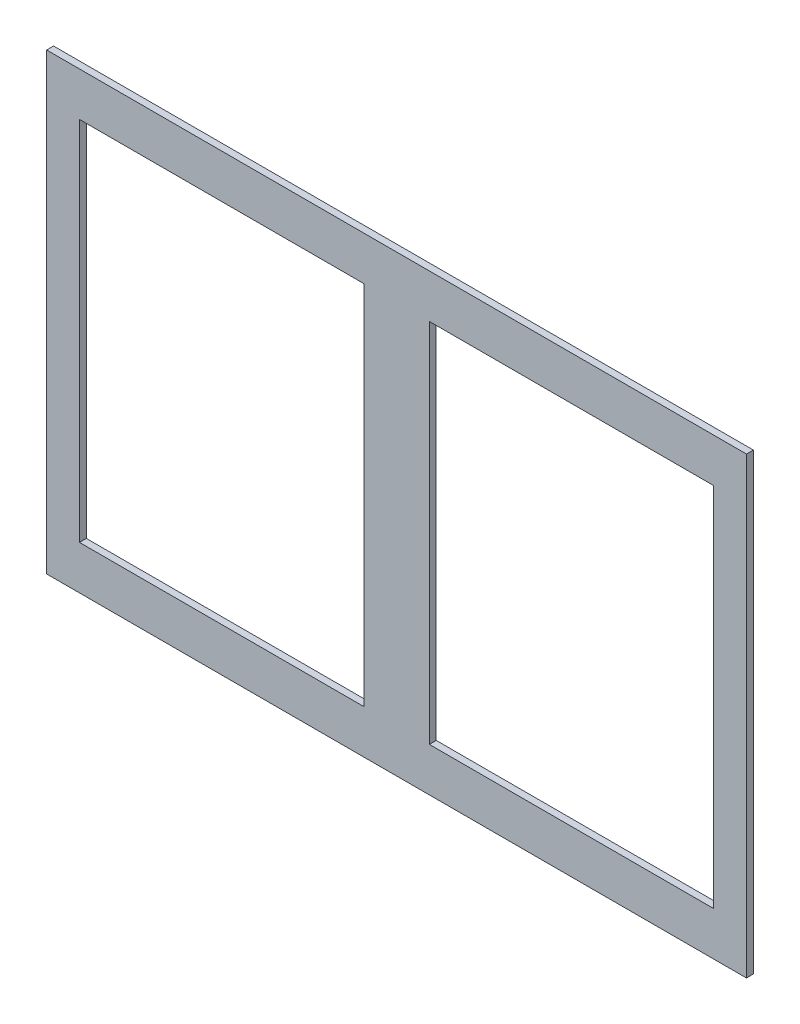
ISO-10303-21;
HEADER;
FILE_DESCRIPTION(('STEP AP214'),'2;1');
FILE_NAME('part.step','',(''),(''),'','','');
FILE_SCHEMA(('AUTOMOTIVE_DESIGN { 1 0 10303 214 1 1 1 1 }'));
ENDSEC;
DATA;
#1=APPLICATION_CONTEXT('core data for automotive mechanical design processes');
#2=APPLICATION_PROTOCOL_DEFINITION('international standard','automotive_design',2000,#1);
#3=PRODUCT_CONTEXT('',#1,'mechanical');
#4=PRODUCT('Part','Part','',(#3));
#5=PRODUCT_RELATED_PRODUCT_CATEGORY('part','',(#4));
#6=PRODUCT_DEFINITION_FORMATION('','',#4);
#7=PRODUCT_DEFINITION_CONTEXT('part definition',#1,'design');
#8=PRODUCT_DEFINITION('design','',#6,#7);
#9=PRODUCT_DEFINITION_SHAPE('','',#8);
#10=(LENGTH_UNIT() NAMED_UNIT(*) SI_UNIT(.MILLI.,.METRE.));
#11=(NAMED_UNIT(*) PLANE_ANGLE_UNIT() SI_UNIT($,.RADIAN.));
#12=(NAMED_UNIT(*) SI_UNIT($,.STERADIAN.) SOLID_ANGLE_UNIT());
#13=UNCERTAINTY_MEASURE_WITH_UNIT(LENGTH_MEASURE(1.E-05),#10,'distance_accuracy_value','');
#14=(GEOMETRIC_REPRESENTATION_CONTEXT(3) GLOBAL_UNCERTAINTY_ASSIGNED_CONTEXT((#13)) GLOBAL_UNIT_ASSIGNED_CONTEXT((#10,
#11,#12)) REPRESENTATION_CONTEXT('',''));
#15=CARTESIAN_POINT('',(0.,0.,0.));
#16=DIRECTION('',(0.,0.,1.));
#17=DIRECTION('',(1.,0.,0.));
#18=AXIS2_PLACEMENT_3D('',#15,#16,#17);
#19=CARTESIAN_POINT('',(0.,425.45,16.));
#20=DIRECTION('',(0.,-1.,0.));
#21=DIRECTION('',(1.,0.,0.));
#22=AXIS2_PLACEMENT_3D('',#19,#20,#21);
#23=PLANE('',#22);
#24=DIRECTION('',(-1.,0.,0.));
#25=VECTOR('',#24,1.);
#26=CARTESIAN_POINT('',(0.,425.45,0.));
#27=LINE('',#26,#25);
#28=CARTESIAN_POINT('',(1143.,425.45,0.));
#29=VERTEX_POINT('',#28);
#30=CARTESIAN_POINT('',(482.6,425.45,0.));
#31=VERTEX_POINT('',#30);
#32=EDGE_CURVE('E211',#29,#31,#27,.T.);
#33=ORIENTED_EDGE('',*,*,#32,.F.);
#34=DIRECTION('',(0.,0.,-1.));
#35=VECTOR('',#34,1.);
#36=CARTESIAN_POINT('',(1143.,425.45,16.));
#37=LINE('',#36,#35);
#38=CARTESIAN_POINT('',(1143.,425.45,16.));
#39=VERTEX_POINT('',#38);
#40=EDGE_CURVE('E11',#39,#29,#37,.T.);
#41=ORIENTED_EDGE('',*,*,#40,.F.);
#42=DIRECTION('',(-1.,0.,0.));
#43=VECTOR('',#42,1.);
#44=CARTESIAN_POINT('',(0.,425.45,16.));
#45=LINE('',#44,#43);
#46=CARTESIAN_POINT('',(482.6,425.45,16.));
#47=VERTEX_POINT('',#46);
#48=EDGE_CURVE('E147',#39,#47,#45,.T.);
#49=ORIENTED_EDGE('',*,*,#48,.T.);
#50=DIRECTION('',(0.,0.,-1.));
#51=VECTOR('',#50,1.);
#52=CARTESIAN_POINT('',(482.6,425.45,16.));
#53=LINE('',#52,#51);
#54=EDGE_CURVE('E56',#47,#31,#53,.T.);
#55=ORIENTED_EDGE('',*,*,#54,.T.);
#56=EDGE_LOOP('',(#33,#41,#49,#55));
#57=FACE_BOUND('',#56,.T.);
#58=ADVANCED_FACE('F37',(#57),#23,.T.);
#59=CARTESIAN_POINT('',(1143.,0.,16.));
#60=DIRECTION('',(1.,0.,0.));
#61=DIRECTION('',(0.,0.,-1.));
#62=AXIS2_PLACEMENT_3D('',#59,#60,#61);
#63=PLANE('',#62);
#64=DIRECTION('',(0.,-1.,0.));
#65=VECTOR('',#64,1.);
#66=CARTESIAN_POINT('',(1143.,0.,0.));
#67=LINE('',#66,#65);
#68=CARTESIAN_POINT('',(1143.,-425.45,0.));
#69=VERTEX_POINT('',#68);
#70=EDGE_CURVE('E152',#29,#69,#67,.T.);
#71=ORIENTED_EDGE('',*,*,#70,.T.);
#72=DIRECTION('',(0.,0.,-1.));
#73=VECTOR('',#72,1.);
#74=CARTESIAN_POINT('',(1143.,-425.45,16.));
#75=LINE('',#74,#73);
#76=CARTESIAN_POINT('',(1143.,-425.45,16.));
#77=VERTEX_POINT('',#76);
#78=EDGE_CURVE('E47',#77,#69,#75,.T.);
#79=ORIENTED_EDGE('',*,*,#78,.F.);
#80=DIRECTION('',(0.,-1.,0.));
#81=VECTOR('',#80,1.);
#82=CARTESIAN_POINT('',(1143.,0.,16.));
#83=LINE('',#82,#81);
#84=EDGE_CURVE('E142',#39,#77,#83,.T.);
#85=ORIENTED_EDGE('',*,*,#84,.F.);
#86=ORIENTED_EDGE('',*,*,#40,.T.);
#87=EDGE_LOOP('',(#71,#79,#85,#86));
#88=FACE_BOUND('',#87,.T.);
#89=ADVANCED_FACE('F150',(#88),#63,.F.);
#90=CARTESIAN_POINT('',(0.,-425.45,16.));
#91=DIRECTION('',(0.,-1.,0.));
#92=DIRECTION('',(1.,0.,0.));
#93=AXIS2_PLACEMENT_3D('',#90,#91,#92);
#94=PLANE('',#93);
#95=DIRECTION('',(-1.,0.,0.));
#96=VECTOR('',#95,1.);
#97=CARTESIAN_POINT('',(0.,-425.45,0.));
#98=LINE('',#97,#96);
#99=CARTESIAN_POINT('',(482.6,-425.45,0.));
#100=VERTEX_POINT('',#99);
#101=EDGE_CURVE('E214',#69,#100,#98,.T.);
#102=ORIENTED_EDGE('',*,*,#101,.T.);
#103=DIRECTION('',(0.,0.,-1.));
#104=VECTOR('',#103,1.);
#105=CARTESIAN_POINT('',(482.6,-425.45,16.));
#106=LINE('',#105,#104);
#107=CARTESIAN_POINT('',(482.6,-425.45,16.));
#108=VERTEX_POINT('',#107);
#109=EDGE_CURVE('E94',#108,#100,#106,.T.);
#110=ORIENTED_EDGE('',*,*,#109,.F.);
#111=DIRECTION('',(-1.,0.,0.));
#112=VECTOR('',#111,1.);
#113=CARTESIAN_POINT('',(0.,-425.45,16.));
#114=LINE('',#113,#112);
#115=EDGE_CURVE('E134',#77,#108,#114,.T.);
#116=ORIENTED_EDGE('',*,*,#115,.F.);
#117=ORIENTED_EDGE('',*,*,#78,.T.);
#118=EDGE_LOOP('',(#102,#110,#116,#117));
#119=FACE_BOUND('',#118,.T.);
#120=ADVANCED_FACE('F136',(#119),#94,.F.);
#121=CARTESIAN_POINT('',(0.,425.45,16.));
#122=DIRECTION('',(0.,1.,0.));
#123=DIRECTION('',(-1.,0.,0.));
#124=AXIS2_PLACEMENT_3D('',#121,#122,#123);
#125=PLANE('',#124);
#126=DIRECTION('',(1.,0.,0.));
#127=VECTOR('',#126,1.);
#128=CARTESIAN_POINT('',(0.,425.45,0.));
#129=LINE('',#128,#127);
#130=CARTESIAN_POINT('',(-330.2,425.45,0.));
#131=VERTEX_POINT('',#130);
#132=CARTESIAN_POINT('',(330.2,425.45,0.));
#133=VERTEX_POINT('',#132);
#134=EDGE_CURVE('E199',#131,#133,#129,.T.);
#135=ORIENTED_EDGE('',*,*,#134,.T.);
#136=DIRECTION('',(0.,0.,-1.));
#137=VECTOR('',#136,1.);
#138=CARTESIAN_POINT('',(330.2,425.45,16.));
#139=LINE('',#138,#137);
#140=CARTESIAN_POINT('',(330.2,425.45,16.));
#141=VERTEX_POINT('',#140);
#142=EDGE_CURVE('E163',#141,#133,#139,.T.);
#143=ORIENTED_EDGE('',*,*,#142,.F.);
#144=DIRECTION('',(1.,0.,0.));
#145=VECTOR('',#144,1.);
#146=CARTESIAN_POINT('',(0.,425.45,16.));
#147=LINE('',#146,#145);
#148=CARTESIAN_POINT('',(-330.2,425.45,16.));
#149=VERTEX_POINT('',#148);
#150=EDGE_CURVE('E226',#149,#141,#147,.T.);
#151=ORIENTED_EDGE('',*,*,#150,.F.);
#152=DIRECTION('',(0.,0.,-1.));
#153=VECTOR('',#152,1.);
#154=CARTESIAN_POINT('',(-330.2,425.45,16.));
#155=LINE('',#154,#153);
#156=EDGE_CURVE('E157',#149,#131,#155,.T.);
#157=ORIENTED_EDGE('',*,*,#156,.T.);
#158=EDGE_LOOP('',(#135,#143,#151,#157));
#159=FACE_BOUND('',#158,.T.);
#160=ADVANCED_FACE('F269',(#159),#125,.F.);
#161=CARTESIAN_POINT('',(330.2,0.,16.));
#162=DIRECTION('',(1.,0.,0.));
#163=DIRECTION('',(0.,0.,-1.));
#164=AXIS2_PLACEMENT_3D('',#161,#162,#163);
#165=PLANE('',#164);
#166=DIRECTION('',(0.,-1.,0.));
#167=VECTOR('',#166,1.);
#168=CARTESIAN_POINT('',(330.2,0.,0.));
#169=LINE('',#168,#167);
#170=CARTESIAN_POINT('',(330.2,-425.45,0.));
#171=VERTEX_POINT('',#170);
#172=EDGE_CURVE('E202',#133,#171,#169,.T.);
#173=ORIENTED_EDGE('',*,*,#172,.T.);
#174=DIRECTION('',(0.,0.,-1.));
#175=VECTOR('',#174,1.);
#176=CARTESIAN_POINT('',(330.2,-425.45,16.));
#177=LINE('',#176,#175);
#178=CARTESIAN_POINT('',(330.2,-425.45,16.));
#179=VERTEX_POINT('',#178);
#180=EDGE_CURVE('E161',#179,#171,#177,.T.);
#181=ORIENTED_EDGE('',*,*,#180,.F.);
#182=DIRECTION('',(0.,-1.,0.));
#183=VECTOR('',#182,1.);
#184=CARTESIAN_POINT('',(330.2,0.,16.));
#185=LINE('',#184,#183);
#186=EDGE_CURVE('E229',#141,#179,#185,.T.);
#187=ORIENTED_EDGE('',*,*,#186,.F.);
#188=ORIENTED_EDGE('',*,*,#142,.T.);
#189=EDGE_LOOP('',(#173,#181,#187,#188));
#190=FACE_BOUND('',#189,.T.);
#191=ADVANCED_FACE('F265',(#190),#165,.F.);
#192=CARTESIAN_POINT('',(0.,-425.45,16.));
#193=DIRECTION('',(0.,1.,0.));
#194=DIRECTION('',(-1.,0.,0.));
#195=AXIS2_PLACEMENT_3D('',#192,#193,#194);
#196=PLANE('',#195);
#197=DIRECTION('',(1.,0.,0.));
#198=VECTOR('',#197,1.);
#199=CARTESIAN_POINT('',(0.,-425.45,0.));
#200=LINE('',#199,#198);
#201=CARTESIAN_POINT('',(-330.2,-425.45,0.));
#202=VERTEX_POINT('',#201);
#203=EDGE_CURVE('E205',#202,#171,#200,.T.);
#204=ORIENTED_EDGE('',*,*,#203,.F.);
#205=DIRECTION('',(0.,0.,-1.));
#206=VECTOR('',#205,1.);
#207=CARTESIAN_POINT('',(-330.2,-425.45,16.));
#208=LINE('',#207,#206);
#209=CARTESIAN_POINT('',(-330.2,-425.45,16.));
#210=VERTEX_POINT('',#209);
#211=EDGE_CURVE('E159',#210,#202,#208,.T.);
#212=ORIENTED_EDGE('',*,*,#211,.F.);
#213=DIRECTION('',(1.,0.,0.));
#214=VECTOR('',#213,1.);
#215=CARTESIAN_POINT('',(0.,-425.45,16.));
#216=LINE('',#215,#214);
#217=EDGE_CURVE('E231',#210,#179,#216,.T.);
#218=ORIENTED_EDGE('',*,*,#217,.T.);
#219=ORIENTED_EDGE('',*,*,#180,.T.);
#220=EDGE_LOOP('',(#204,#212,#218,#219));
#221=FACE_BOUND('',#220,.T.);
#222=ADVANCED_FACE('F262',(#221),#196,.T.);
#223=CARTESIAN_POINT('',(0.,-527.05,16.));
#224=DIRECTION('',(0.,1.,0.));
#225=DIRECTION('',(0.,0.,1.));
#226=AXIS2_PLACEMENT_3D('',#223,#224,#225);
#227=PLANE('',#226);
#228=DIRECTION('',(1.,0.,0.));
#229=VECTOR('',#228,1.);
#230=CARTESIAN_POINT('',(0.,-527.05,0.));
#231=LINE('',#230,#229);
#232=CARTESIAN_POINT('',(-406.4,-527.05,0.));
#233=VERTEX_POINT('',#232);
#234=CARTESIAN_POINT('',(1219.2,-527.05,0.));
#235=VERTEX_POINT('',#234);
#236=EDGE_CURVE('E185',#233,#235,#231,.T.);
#237=ORIENTED_EDGE('',*,*,#236,.T.);
#238=DIRECTION('',(0.,0.,-1.));
#239=VECTOR('',#238,1.);
#240=CARTESIAN_POINT('',(1219.2,-527.05,16.));
#241=LINE('',#240,#239);
#242=CARTESIAN_POINT('',(1219.2,-527.05,16.));
#243=VERTEX_POINT('',#242);
#244=EDGE_CURVE('E41',#243,#235,#241,.T.);
#245=ORIENTED_EDGE('',*,*,#244,.F.);
#246=DIRECTION('',(1.,0.,0.));
#247=VECTOR('',#246,1.);
#248=CARTESIAN_POINT('',(0.,-527.05,16.));
#249=LINE('',#248,#247);
#250=CARTESIAN_POINT('',(-406.4,-527.05,16.));
#251=VERTEX_POINT('',#250);
#252=EDGE_CURVE('E107',#251,#243,#249,.T.);
#253=ORIENTED_EDGE('',*,*,#252,.F.);
#254=DIRECTION('',(0.,0.,-1.));
#255=VECTOR('',#254,1.);
#256=CARTESIAN_POINT('',(-406.4,-527.05,16.));
#257=LINE('',#256,#255);
#258=EDGE_CURVE('E166',#251,#233,#257,.T.);
#259=ORIENTED_EDGE('',*,*,#258,.T.);
#260=EDGE_LOOP('',(#237,#245,#253,#259));
#261=FACE_BOUND('',#260,.T.);
#262=ADVANCED_FACE('F39',(#261),#227,.F.);
#263=CARTESIAN_POINT('',(1219.2,-2.5682267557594E-13,16.));
#264=DIRECTION('',(1.,0.,0.));
#265=DIRECTION('',(0.,1.,0.));
#266=AXIS2_PLACEMENT_3D('',#263,#264,#265);
#267=PLANE('',#266);
#268=DIRECTION('',(0.,-1.,0.));
#269=VECTOR('',#268,1.);
#270=CARTESIAN_POINT('',(1219.2,-2.5682267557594E-13,0.));
#271=LINE('',#270,#269);
#272=CARTESIAN_POINT('',(1219.2,527.05,0.));
#273=VERTEX_POINT('',#272);
#274=EDGE_CURVE('E180',#273,#235,#271,.T.);
#275=ORIENTED_EDGE('',*,*,#274,.F.);
#276=DIRECTION('',(0.,0.,-1.));
#277=VECTOR('',#276,1.);
#278=CARTESIAN_POINT('',(1219.2,527.05,16.));
#279=LINE('',#278,#277);
#280=CARTESIAN_POINT('',(1219.2,527.05,16.));
#281=VERTEX_POINT('',#280);
#282=EDGE_CURVE('E170',#281,#273,#279,.T.);
#283=ORIENTED_EDGE('',*,*,#282,.F.);
#284=DIRECTION('',(0.,-1.,0.));
#285=VECTOR('',#284,1.);
#286=CARTESIAN_POINT('',(1219.2,-2.5682267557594E-13,16.));
#287=LINE('',#286,#285);
#288=EDGE_CURVE('E182',#281,#243,#287,.T.);
#289=ORIENTED_EDGE('',*,*,#288,.T.);
#290=ORIENTED_EDGE('',*,*,#244,.T.);
#291=EDGE_LOOP('',(#275,#283,#289,#290));
#292=FACE_BOUND('',#291,.T.);
#293=ADVANCED_FACE('F178',(#292),#267,.T.);
#294=CARTESIAN_POINT('',(0.,527.05,16.));
#295=DIRECTION('',(0.,1.,0.));
#296=DIRECTION('',(0.,0.,1.));
#297=AXIS2_PLACEMENT_3D('',#294,#295,#296);
#298=PLANE('',#297);
#299=DIRECTION('',(1.,0.,0.));
#300=VECTOR('',#299,1.);
#301=CARTESIAN_POINT('',(0.,527.05,0.));
#302=LINE('',#301,#300);
#303=CARTESIAN_POINT('',(-406.4,527.05,0.));
#304=VERTEX_POINT('',#303);
#305=EDGE_CURVE('E192',#304,#273,#302,.T.);
#306=ORIENTED_EDGE('',*,*,#305,.F.);
#307=DIRECTION('',(0.,0.,-1.));
#308=VECTOR('',#307,1.);
#309=CARTESIAN_POINT('',(-406.4,527.05,16.));
#310=LINE('',#309,#308);
#311=CARTESIAN_POINT('',(-406.4,527.05,16.));
#312=VERTEX_POINT('',#311);
#313=EDGE_CURVE('E169',#312,#304,#310,.T.);
#314=ORIENTED_EDGE('',*,*,#313,.F.);
#315=DIRECTION('',(1.,0.,0.));
#316=VECTOR('',#315,1.);
#317=CARTESIAN_POINT('',(0.,527.05,16.));
#318=LINE('',#317,#316);
#319=EDGE_CURVE('E220',#312,#281,#318,.T.);
#320=ORIENTED_EDGE('',*,*,#319,.T.);
#321=ORIENTED_EDGE('',*,*,#282,.T.);
#322=EDGE_LOOP('',(#306,#314,#320,#321));
#323=FACE_BOUND('',#322,.T.);
#324=ADVANCED_FACE('F260',(#323),#298,.T.);
#325=CARTESIAN_POINT('',(-330.2,0.,16.));
#326=DIRECTION('',(1.,0.,0.));
#327=DIRECTION('',(0.,0.,-1.));
#328=AXIS2_PLACEMENT_3D('',#325,#326,#327);
#329=PLANE('',#328);
#330=DIRECTION('',(0.,-1.,0.));
#331=VECTOR('',#330,1.);
#332=CARTESIAN_POINT('',(-330.2,0.,0.));
#333=LINE('',#332,#331);
#334=EDGE_CURVE('E208',#131,#202,#333,.T.);
#335=ORIENTED_EDGE('',*,*,#334,.F.);
#336=ORIENTED_EDGE('',*,*,#156,.F.);
#337=DIRECTION('',(0.,-1.,0.));
#338=VECTOR('',#337,1.);
#339=CARTESIAN_POINT('',(-330.2,0.,16.));
#340=LINE('',#339,#338);
#341=EDGE_CURVE('E234',#149,#210,#340,.T.);
#342=ORIENTED_EDGE('',*,*,#341,.T.);
#343=ORIENTED_EDGE('',*,*,#211,.T.);
#344=EDGE_LOOP('',(#335,#336,#342,#343));
#345=FACE_BOUND('',#344,.T.);
#346=ADVANCED_FACE('F246',(#345),#329,.T.);
#347=CARTESIAN_POINT('',(-406.4,0.,16.));
#348=DIRECTION('',(1.,0.,0.));
#349=DIRECTION('',(0.,1.,0.));
#350=AXIS2_PLACEMENT_3D('',#347,#348,#349);
#351=PLANE('',#350);
#352=DIRECTION('',(0.,-1.,0.));
#353=VECTOR('',#352,1.);
#354=CARTESIAN_POINT('',(-406.4,0.,0.));
#355=LINE('',#354,#353);
#356=EDGE_CURVE('E194',#304,#233,#355,.T.);
#357=ORIENTED_EDGE('',*,*,#356,.T.);
#358=ORIENTED_EDGE('',*,*,#258,.F.);
#359=DIRECTION('',(0.,-1.,0.));
#360=VECTOR('',#359,1.);
#361=CARTESIAN_POINT('',(-406.4,0.,16.));
#362=LINE('',#361,#360);
#363=EDGE_CURVE('E224',#312,#251,#362,.T.);
#364=ORIENTED_EDGE('',*,*,#363,.F.);
#365=ORIENTED_EDGE('',*,*,#313,.T.);
#366=EDGE_LOOP('',(#357,#358,#364,#365));
#367=FACE_BOUND('',#366,.T.);
#368=ADVANCED_FACE('F239',(#367),#351,.F.);
#369=CARTESIAN_POINT('',(482.6,0.,16.));
#370=DIRECTION('',(1.,0.,0.));
#371=DIRECTION('',(0.,0.,-1.));
#372=AXIS2_PLACEMENT_3D('',#369,#370,#371);
#373=PLANE('',#372);
#374=DIRECTION('',(0.,-1.,0.));
#375=VECTOR('',#374,1.);
#376=CARTESIAN_POINT('',(482.6,0.,0.));
#377=LINE('',#376,#375);
#378=EDGE_CURVE('E216',#31,#100,#377,.T.);
#379=ORIENTED_EDGE('',*,*,#378,.F.);
#380=ORIENTED_EDGE('',*,*,#54,.F.);
#381=DIRECTION('',(0.,-1.,0.));
#382=VECTOR('',#381,1.);
#383=CARTESIAN_POINT('',(482.6,0.,16.));
#384=LINE('',#383,#382);
#385=EDGE_CURVE('E141',#47,#108,#384,.T.);
#386=ORIENTED_EDGE('',*,*,#385,.T.);
#387=ORIENTED_EDGE('',*,*,#109,.T.);
#388=EDGE_LOOP('',(#379,#380,#386,#387));
#389=FACE_BOUND('',#388,.T.);
#390=ADVANCED_FACE('F237',(#389),#373,.T.);
#391=CARTESIAN_POINT('',(0.,0.,16.));
#392=DIRECTION('',(0.,0.,1.));
#393=DIRECTION('',(1.,0.,0.));
#394=AXIS2_PLACEMENT_3D('',#391,#392,#393);
#395=PLANE('',#394);
#396=ORIENTED_EDGE('',*,*,#252,.T.);
#397=ORIENTED_EDGE('',*,*,#288,.F.);
#398=ORIENTED_EDGE('',*,*,#319,.F.);
#399=ORIENTED_EDGE('',*,*,#363,.T.);
#400=EDGE_LOOP('',(#396,#397,#398,#399));
#401=FACE_BOUND('',#400,.T.);
#402=ORIENTED_EDGE('',*,*,#150,.T.);
#403=ORIENTED_EDGE('',*,*,#186,.T.);
#404=ORIENTED_EDGE('',*,*,#217,.F.);
#405=ORIENTED_EDGE('',*,*,#341,.F.);
#406=EDGE_LOOP('',(#402,#403,#404,#405));
#407=FACE_BOUND('',#406,.T.);
#408=ORIENTED_EDGE('',*,*,#48,.F.);
#409=ORIENTED_EDGE('',*,*,#84,.T.);
#410=ORIENTED_EDGE('',*,*,#115,.T.);
#411=ORIENTED_EDGE('',*,*,#385,.F.);
#412=EDGE_LOOP('',(#408,#409,#410,#411));
#413=FACE_BOUND('',#412,.T.);
#414=ADVANCED_FACE('F146',(#401,#407,#413),#395,.T.);
#415=CARTESIAN_POINT('',(0.,0.,0.));
#416=DIRECTION('',(0.,0.,1.));
#417=DIRECTION('',(1.,0.,0.));
#418=AXIS2_PLACEMENT_3D('',#415,#416,#417);
#419=PLANE('',#418);
#420=ORIENTED_EDGE('',*,*,#236,.F.);
#421=ORIENTED_EDGE('',*,*,#356,.F.);
#422=ORIENTED_EDGE('',*,*,#305,.T.);
#423=ORIENTED_EDGE('',*,*,#274,.T.);
#424=EDGE_LOOP('',(#420,#421,#422,#423));
#425=FACE_BOUND('',#424,.T.);
#426=ORIENTED_EDGE('',*,*,#134,.F.);
#427=ORIENTED_EDGE('',*,*,#334,.T.);
#428=ORIENTED_EDGE('',*,*,#203,.T.);
#429=ORIENTED_EDGE('',*,*,#172,.F.);
#430=EDGE_LOOP('',(#426,#427,#428,#429));
#431=FACE_BOUND('',#430,.T.);
#432=ORIENTED_EDGE('',*,*,#32,.T.);
#433=ORIENTED_EDGE('',*,*,#378,.T.);
#434=ORIENTED_EDGE('',*,*,#101,.F.);
#435=ORIENTED_EDGE('',*,*,#70,.F.);
#436=EDGE_LOOP('',(#432,#433,#434,#435));
#437=FACE_BOUND('',#436,.T.);
#438=ADVANCED_FACE('F190',(#425,#431,#437),#419,.F.);
#439=CLOSED_SHELL('',(#58,#89,#120,#160,#191,#222,#262,#293,#324,#346,#368,#390,#414,#438));
#440=MANIFOLD_SOLID_BREP('B2',#439);
#441=ADVANCED_BREP_SHAPE_REPRESENTATION('',(#18,#440),#14);
#442=SHAPE_DEFINITION_REPRESENTATION(#9,#441);
ENDSEC;
END-ISO-10303-21;
